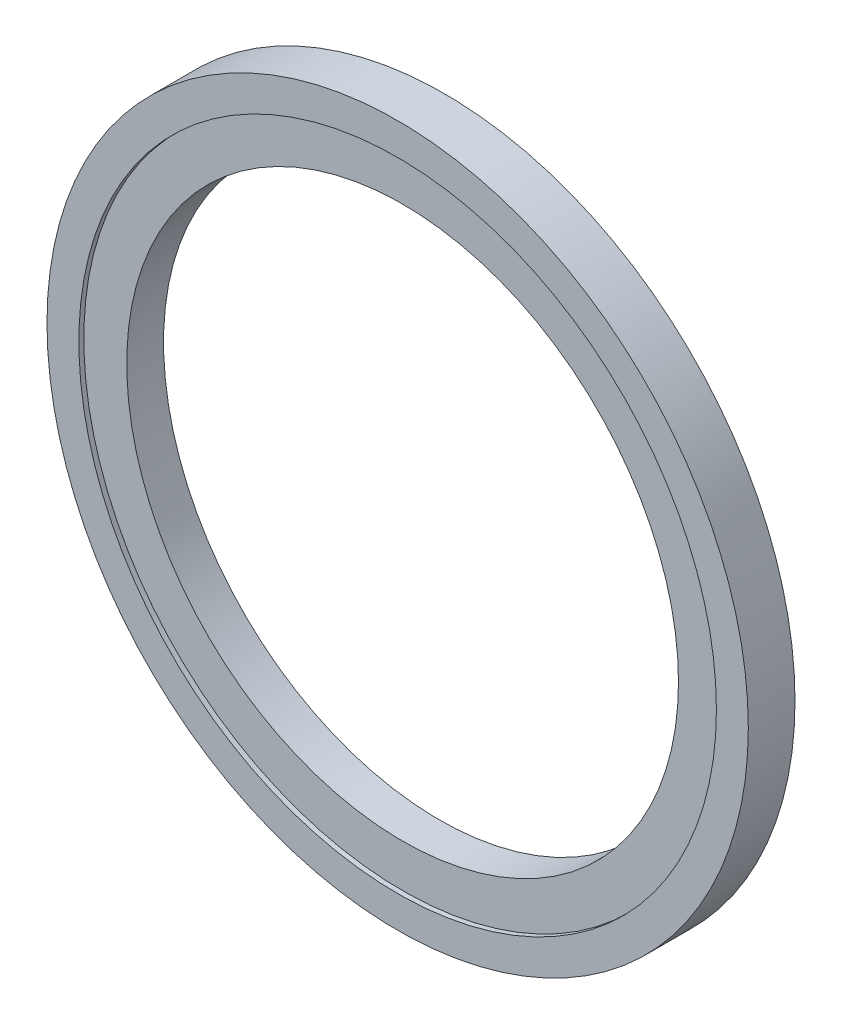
ISO-10303-21;
HEADER;
FILE_DESCRIPTION(('STEP AP214'),'2;1');
FILE_NAME('part.step','',(''),(''),'','','');
FILE_SCHEMA(('AUTOMOTIVE_DESIGN { 1 0 10303 214 1 1 1 1 }'));
ENDSEC;
DATA;
#1=APPLICATION_CONTEXT('core data for automotive mechanical design processes');
#2=APPLICATION_PROTOCOL_DEFINITION('international standard','automotive_design',2000,#1);
#3=PRODUCT_CONTEXT('',#1,'mechanical');
#4=PRODUCT('Part','Part','',(#3));
#5=PRODUCT_RELATED_PRODUCT_CATEGORY('part','',(#4));
#6=PRODUCT_DEFINITION_FORMATION('','',#4);
#7=PRODUCT_DEFINITION_CONTEXT('part definition',#1,'design');
#8=PRODUCT_DEFINITION('design','',#6,#7);
#9=PRODUCT_DEFINITION_SHAPE('','',#8);
#10=(LENGTH_UNIT() NAMED_UNIT(*) SI_UNIT(.MILLI.,.METRE.));
#11=(NAMED_UNIT(*) PLANE_ANGLE_UNIT() SI_UNIT($,.RADIAN.));
#12=(NAMED_UNIT(*) SI_UNIT($,.STERADIAN.) SOLID_ANGLE_UNIT());
#13=UNCERTAINTY_MEASURE_WITH_UNIT(LENGTH_MEASURE(1.E-05),#10,'distance_accuracy_value','');
#14=(GEOMETRIC_REPRESENTATION_CONTEXT(3) GLOBAL_UNCERTAINTY_ASSIGNED_CONTEXT((#13)) GLOBAL_UNIT_ASSIGNED_CONTEXT((#10,
#11,#12)) REPRESENTATION_CONTEXT('',''));
#15=CARTESIAN_POINT('',(0.,0.,0.));
#16=DIRECTION('',(0.,0.,1.));
#17=DIRECTION('',(1.,0.,0.));
#18=AXIS2_PLACEMENT_3D('',#15,#16,#17);
#19=CARTESIAN_POINT('',(0.,0.,-19.05));
#20=DIRECTION('',(0.,0.,1.));
#21=DIRECTION('',(1.,0.,0.));
#22=AXIS2_PLACEMENT_3D('',#19,#20,#21);
#23=CYLINDRICAL_SURFACE('',#22,260.);
#24=CARTESIAN_POINT('',(0.,0.,-19.05));
#25=DIRECTION('',(0.,0.,1.));
#26=DIRECTION('',(1.,0.,0.));
#27=AXIS2_PLACEMENT_3D('',#24,#25,#26);
#28=CIRCLE('',#27,260.);
#29=CARTESIAN_POINT('',(260.,0.,-19.05));
#30=VERTEX_POINT('',#29);
#31=EDGE_CURVE('E80',#30,#30,#28,.T.);
#32=CARTESIAN_POINT('',(0.,0.,-15.));
#33=DIRECTION('',(0.,0.,1.));
#34=DIRECTION('',(1.,0.,0.));
#35=AXIS2_PLACEMENT_3D('',#32,#33,#34);
#36=CIRCLE('',#35,260.);
#37=CARTESIAN_POINT('',(260.,0.,-15.));
#38=VERTEX_POINT('',#37);
#39=EDGE_CURVE('E11',#38,#38,#36,.F.);
#40=CARTESIAN_POINT('',(260.,0.,-19.05));
#41=CARTESIAN_POINT('',(260.,0.,-19.0078125));
#42=CARTESIAN_POINT('',(260.,0.,-18.965625));
#43=CARTESIAN_POINT('',(260.,0.,-18.88125));
#44=CARTESIAN_POINT('',(260.,0.,-18.8390625));
#45=CARTESIAN_POINT('',(260.,0.,-18.7546875));
#46=CARTESIAN_POINT('',(260.,0.,-18.7125));
#47=CARTESIAN_POINT('',(260.,0.,-18.628125));
#48=CARTESIAN_POINT('',(260.,0.,-18.5859375));
#49=CARTESIAN_POINT('',(260.,0.,-18.5015625));
#50=CARTESIAN_POINT('',(260.,0.,-18.459375));
#51=CARTESIAN_POINT('',(260.,0.,-18.375));
#52=CARTESIAN_POINT('',(260.,0.,-18.3328125));
#53=CARTESIAN_POINT('',(260.,0.,-18.2484375));
#54=CARTESIAN_POINT('',(260.,0.,-18.20625));
#55=CARTESIAN_POINT('',(260.,0.,-18.121875));
#56=CARTESIAN_POINT('',(260.,0.,-18.0796875));
#57=CARTESIAN_POINT('',(260.,0.,-17.9953125));
#58=CARTESIAN_POINT('',(260.,0.,-17.953125));
#59=CARTESIAN_POINT('',(260.,0.,-17.86875));
#60=CARTESIAN_POINT('',(260.,0.,-17.8265625));
#61=CARTESIAN_POINT('',(260.,0.,-17.7421875));
#62=CARTESIAN_POINT('',(260.,0.,-17.7));
#63=CARTESIAN_POINT('',(260.,0.,-17.615625));
#64=CARTESIAN_POINT('',(260.,0.,-17.5734375));
#65=CARTESIAN_POINT('',(260.,0.,-17.4890625));
#66=CARTESIAN_POINT('',(260.,0.,-17.446875));
#67=CARTESIAN_POINT('',(260.,0.,-17.3625));
#68=CARTESIAN_POINT('',(260.,0.,-17.3203125));
#69=CARTESIAN_POINT('',(260.,0.,-17.2359375));
#70=CARTESIAN_POINT('',(260.,0.,-17.19375));
#71=CARTESIAN_POINT('',(260.,0.,-17.109375));
#72=CARTESIAN_POINT('',(260.,0.,-17.0671875));
#73=CARTESIAN_POINT('',(260.,0.,-16.9828125));
#74=CARTESIAN_POINT('',(260.,0.,-16.940625));
#75=CARTESIAN_POINT('',(260.,0.,-16.85625));
#76=CARTESIAN_POINT('',(260.,0.,-16.8140625));
#77=CARTESIAN_POINT('',(260.,0.,-16.7296875));
#78=CARTESIAN_POINT('',(260.,0.,-16.6875));
#79=CARTESIAN_POINT('',(260.,0.,-16.603125));
#80=CARTESIAN_POINT('',(260.,0.,-16.5609375));
#81=CARTESIAN_POINT('',(260.,0.,-16.4765625));
#82=CARTESIAN_POINT('',(260.,0.,-16.434375));
#83=CARTESIAN_POINT('',(260.,0.,-16.35));
#84=CARTESIAN_POINT('',(260.,0.,-16.3078125));
#85=CARTESIAN_POINT('',(260.,0.,-16.2234375));
#86=CARTESIAN_POINT('',(260.,0.,-16.18125));
#87=CARTESIAN_POINT('',(260.,0.,-16.096875));
#88=CARTESIAN_POINT('',(260.,0.,-16.0546875));
#89=CARTESIAN_POINT('',(260.,0.,-15.9703125));
#90=CARTESIAN_POINT('',(260.,0.,-15.928125));
#91=CARTESIAN_POINT('',(260.,0.,-15.84375));
#92=CARTESIAN_POINT('',(260.,0.,-15.8015625));
#93=CARTESIAN_POINT('',(260.,0.,-15.7171875));
#94=CARTESIAN_POINT('',(260.,0.,-15.675));
#95=CARTESIAN_POINT('',(260.,0.,-15.590625));
#96=CARTESIAN_POINT('',(260.,0.,-15.5484375));
#97=CARTESIAN_POINT('',(260.,0.,-15.4640625));
#98=CARTESIAN_POINT('',(260.,0.,-15.421875));
#99=CARTESIAN_POINT('',(260.,0.,-15.3375));
#100=CARTESIAN_POINT('',(260.,0.,-15.2953125));
#101=CARTESIAN_POINT('',(260.,0.,-15.2109375));
#102=CARTESIAN_POINT('',(260.,0.,-15.16875));
#103=CARTESIAN_POINT('',(260.,0.,-15.084375));
#104=CARTESIAN_POINT('',(260.,0.,-15.0421875));
#105=CARTESIAN_POINT('',(260.,0.,-15.));
#106=B_SPLINE_CURVE_WITH_KNOTS('',3,(#40,#41,#42,#43,#44,#45,#46,#47,#48,#49,#50,#51,#52,#53,
#54,#55,#56,#57,#58,#59,#60,#61,#62,#63,#64,#65,#66,#67,#68,#69,#70,#71,#72,#73,#74,#75,#76,#77,
#78,#79,#80,#81,#82,#83,#84,#85,#86,#87,#88,#89,#90,#91,#92,#93,#94,#95,#96,#97,#98,#99,#100,
#101,#102,#103,#104,#105),.UNSPECIFIED.,.F.,.F.,(4,2,2,2,2,2,2,2,2,2,2,2,2,2,2,2,2,2,2,2,2,2,2,
2,2,2,2,2,2,2,2,2,4),(0.,0.126562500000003,0.253125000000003,0.379687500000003,
0.506250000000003,0.632812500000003,0.759375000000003,0.885937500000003,1.0125,1.1390625,
1.265625,1.3921875,1.51875,1.6453125,1.771875,1.8984375,2.025,2.1515625,2.278125,2.4046875,
2.53125,2.6578125,2.784375,2.9109375,3.03750000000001,3.1640625,3.29062500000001,
3.41718750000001,3.54375,3.6703125,3.79687500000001,3.92343750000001,4.05000000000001),.UNSPECIFIED.);
#107=EDGE_CURVE('BSEAM67',#30,#38,#106,.T.);
#108=ORIENTED_EDGE('',*,*,#31,.F.);
#109=ORIENTED_EDGE('',*,*,#39,.F.);
#110=ORIENTED_EDGE('',*,*,#107,.T.);
#111=ORIENTED_EDGE('',*,*,#107,.F.);
#112=EDGE_LOOP('',(#108,#110,#109,#111));
#113=FACE_BOUND('',#112,.T.);
#114=ADVANCED_FACE('F67',(#113),#23,.F.);
#115=CARTESIAN_POINT('',(0.,0.,-19.05));
#116=DIRECTION('',(0.,0.,1.));
#117=DIRECTION('',(1.,0.,0.));
#118=AXIS2_PLACEMENT_3D('',#115,#116,#117);
#119=CYLINDRICAL_SURFACE('',#118,286.);
#120=CARTESIAN_POINT('',(0.,0.,-19.05));
#121=DIRECTION('',(0.,0.,1.));
#122=DIRECTION('',(1.,0.,0.));
#123=AXIS2_PLACEMENT_3D('',#120,#121,#122);
#124=CIRCLE('',#123,286.);
#125=CARTESIAN_POINT('',(286.,0.,-19.05));
#126=VERTEX_POINT('',#125);
#127=EDGE_CURVE('E75',#126,#126,#124,.T.);
#128=CARTESIAN_POINT('',(0.,0.,19.05));
#129=DIRECTION('',(0.,0.,1.));
#130=DIRECTION('',(1.,0.,0.));
#131=AXIS2_PLACEMENT_3D('',#128,#129,#130);
#132=CIRCLE('',#131,286.);
#133=CARTESIAN_POINT('',(286.,0.,19.05));
#134=VERTEX_POINT('',#133);
#135=EDGE_CURVE('E85',#134,#134,#132,.T.);
#136=CARTESIAN_POINT('',(286.,0.,-19.05));
#137=CARTESIAN_POINT('',(286.,0.,-18.653125));
#138=CARTESIAN_POINT('',(286.,0.,-18.25625));
#139=CARTESIAN_POINT('',(286.,0.,-17.4625));
#140=CARTESIAN_POINT('',(286.,0.,-17.065625));
#141=CARTESIAN_POINT('',(286.,0.,-16.271875));
#142=CARTESIAN_POINT('',(286.,0.,-15.875));
#143=CARTESIAN_POINT('',(286.,0.,-15.08125));
#144=CARTESIAN_POINT('',(286.,0.,-14.684375));
#145=CARTESIAN_POINT('',(286.,0.,-13.890625));
#146=CARTESIAN_POINT('',(286.,0.,-13.49375));
#147=CARTESIAN_POINT('',(286.,0.,-12.7));
#148=CARTESIAN_POINT('',(286.,0.,-12.303125));
#149=CARTESIAN_POINT('',(286.,0.,-11.509375));
#150=CARTESIAN_POINT('',(286.,0.,-11.1125));
#151=CARTESIAN_POINT('',(286.,0.,-10.31875));
#152=CARTESIAN_POINT('',(286.,0.,-9.921875));
#153=CARTESIAN_POINT('',(286.,0.,-9.128125));
#154=CARTESIAN_POINT('',(286.,0.,-8.73125));
#155=CARTESIAN_POINT('',(286.,0.,-7.9375));
#156=CARTESIAN_POINT('',(286.,0.,-7.540625));
#157=CARTESIAN_POINT('',(286.,0.,-6.746875));
#158=CARTESIAN_POINT('',(286.,0.,-6.35));
#159=CARTESIAN_POINT('',(286.,0.,-5.55625));
#160=CARTESIAN_POINT('',(286.,0.,-5.159375));
#161=CARTESIAN_POINT('',(286.,0.,-4.365625));
#162=CARTESIAN_POINT('',(286.,0.,-3.96875));
#163=CARTESIAN_POINT('',(286.,0.,-3.175));
#164=CARTESIAN_POINT('',(286.,0.,-2.778125));
#165=CARTESIAN_POINT('',(286.,0.,-1.984375));
#166=CARTESIAN_POINT('',(286.,0.,-1.5875));
#167=CARTESIAN_POINT('',(286.,0.,-0.793750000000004));
#168=CARTESIAN_POINT('',(286.,0.,-0.396875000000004));
#169=CARTESIAN_POINT('',(286.,0.,0.396874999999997));
#170=CARTESIAN_POINT('',(286.,0.,0.793749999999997));
#171=CARTESIAN_POINT('',(286.,0.,1.5875));
#172=CARTESIAN_POINT('',(286.,0.,1.984375));
#173=CARTESIAN_POINT('',(286.,0.,2.778125));
#174=CARTESIAN_POINT('',(286.,0.,3.175));
#175=CARTESIAN_POINT('',(286.,0.,3.96875));
#176=CARTESIAN_POINT('',(286.,0.,4.365625));
#177=CARTESIAN_POINT('',(286.,0.,5.159375));
#178=CARTESIAN_POINT('',(286.,0.,5.55625));
#179=CARTESIAN_POINT('',(286.,0.,6.35));
#180=CARTESIAN_POINT('',(286.,0.,6.746875));
#181=CARTESIAN_POINT('',(286.,0.,7.540625));
#182=CARTESIAN_POINT('',(286.,0.,7.9375));
#183=CARTESIAN_POINT('',(286.,0.,8.73125));
#184=CARTESIAN_POINT('',(286.,0.,9.128125));
#185=CARTESIAN_POINT('',(286.,0.,9.921875));
#186=CARTESIAN_POINT('',(286.,0.,10.31875));
#187=CARTESIAN_POINT('',(286.,0.,11.1125));
#188=CARTESIAN_POINT('',(286.,0.,11.509375));
#189=CARTESIAN_POINT('',(286.,0.,12.303125));
#190=CARTESIAN_POINT('',(286.,0.,12.7));
#191=CARTESIAN_POINT('',(286.,0.,13.49375));
#192=CARTESIAN_POINT('',(286.,0.,13.890625));
#193=CARTESIAN_POINT('',(286.,0.,14.684375));
#194=CARTESIAN_POINT('',(286.,0.,15.08125));
#195=CARTESIAN_POINT('',(286.,0.,15.875));
#196=CARTESIAN_POINT('',(286.,0.,16.271875));
#197=CARTESIAN_POINT('',(286.,0.,17.065625));
#198=CARTESIAN_POINT('',(286.,0.,17.4625));
#199=CARTESIAN_POINT('',(286.,0.,18.25625));
#200=CARTESIAN_POINT('',(286.,0.,18.653125));
#201=CARTESIAN_POINT('',(286.,0.,19.05));
#202=B_SPLINE_CURVE_WITH_KNOTS('',3,(#136,#137,#138,#139,#140,#141,#142,#143,#144,#145,#146,
#147,#148,#149,#150,#151,#152,#153,#154,#155,#156,#157,#158,#159,#160,#161,#162,#163,#164,#165,
#166,#167,#168,#169,#170,#171,#172,#173,#174,#175,#176,#177,#178,#179,#180,#181,#182,#183,#184,
#185,#186,#187,#188,#189,#190,#191,#192,#193,#194,#195,#196,#197,#198,#199,#200,#201),
.UNSPECIFIED.,.F.,.F.,(4,2,2,2,2,2,2,2,2,2,2,2,2,2,2,2,2,2,2,2,2,2,2,2,2,2,2,2,2,2,2,2,4),(0.,
1.190625,2.38125,3.571875,4.7625,5.953125,7.14375,8.334375,9.525,10.715625,11.90625,13.096875,
14.2875,15.478125,16.66875,17.859375,19.05,20.240625,21.43125,22.621875,23.8125,25.003125,
26.19375,27.384375,28.575,29.765625,30.95625,32.146875,33.3375,34.528125,35.71875,36.909375,
38.1),.UNSPECIFIED.);
#203=EDGE_CURVE('BSEAM69',#126,#134,#202,.T.);
#204=ORIENTED_EDGE('',*,*,#127,.T.);
#205=ORIENTED_EDGE('',*,*,#135,.F.);
#206=ORIENTED_EDGE('',*,*,#203,.T.);
#207=ORIENTED_EDGE('',*,*,#203,.F.);
#208=EDGE_LOOP('',(#204,#206,#205,#207));
#209=FACE_BOUND('',#208,.T.);
#210=ADVANCED_FACE('F69',(#209),#119,.T.);
#211=CARTESIAN_POINT('',(0.,0.,-19.05));
#212=DIRECTION('',(0.,0.,1.));
#213=DIRECTION('',(1.,0.,0.));
#214=AXIS2_PLACEMENT_3D('',#211,#212,#213);
#215=PLANE('',#214);
#216=ORIENTED_EDGE('',*,*,#31,.T.);
#217=EDGE_LOOP('',(#216));
#218=FACE_BOUND('',#217,.T.);
#219=ORIENTED_EDGE('',*,*,#127,.F.);
#220=EDGE_LOOP('',(#219));
#221=FACE_BOUND('',#220,.T.);
#222=ADVANCED_FACE('F129',(#218,#221),#215,.F.);
#223=CARTESIAN_POINT('',(0.,0.,15.));
#224=DIRECTION('',(0.,0.,1.));
#225=DIRECTION('',(1.,0.,0.));
#226=AXIS2_PLACEMENT_3D('',#223,#224,#225);
#227=CIRCLE('',#226,260.);
#228=CARTESIAN_POINT('',(260.,0.,15.));
#229=VERTEX_POINT('',#228);
#230=EDGE_CURVE('E99',#229,#229,#227,.T.);
#231=CARTESIAN_POINT('',(0.,0.,19.05));
#232=DIRECTION('',(0.,0.,1.));
#233=DIRECTION('',(1.,0.,0.));
#234=AXIS2_PLACEMENT_3D('',#231,#232,#233);
#235=CIRCLE('',#234,260.);
#236=CARTESIAN_POINT('',(260.,0.,19.05));
#237=VERTEX_POINT('',#236);
#238=EDGE_CURVE('E91',#237,#237,#235,.T.);
#239=CARTESIAN_POINT('',(260.,0.,15.));
#240=CARTESIAN_POINT('',(260.,0.,15.0421875));
#241=CARTESIAN_POINT('',(260.,0.,15.084375));
#242=CARTESIAN_POINT('',(260.,0.,15.16875));
#243=CARTESIAN_POINT('',(260.,0.,15.2109375));
#244=CARTESIAN_POINT('',(260.,0.,15.2953125));
#245=CARTESIAN_POINT('',(260.,0.,15.3375));
#246=CARTESIAN_POINT('',(260.,0.,15.421875));
#247=CARTESIAN_POINT('',(260.,0.,15.4640625));
#248=CARTESIAN_POINT('',(260.,0.,15.5484375));
#249=CARTESIAN_POINT('',(260.,0.,15.590625));
#250=CARTESIAN_POINT('',(260.,0.,15.675));
#251=CARTESIAN_POINT('',(260.,0.,15.7171875));
#252=CARTESIAN_POINT('',(260.,0.,15.8015625));
#253=CARTESIAN_POINT('',(260.,0.,15.84375));
#254=CARTESIAN_POINT('',(260.,0.,15.928125));
#255=CARTESIAN_POINT('',(260.,0.,15.9703125));
#256=CARTESIAN_POINT('',(260.,0.,16.0546875));
#257=CARTESIAN_POINT('',(260.,0.,16.096875));
#258=CARTESIAN_POINT('',(260.,0.,16.18125));
#259=CARTESIAN_POINT('',(260.,0.,16.2234375));
#260=CARTESIAN_POINT('',(260.,0.,16.3078125));
#261=CARTESIAN_POINT('',(260.,0.,16.35));
#262=CARTESIAN_POINT('',(260.,0.,16.434375));
#263=CARTESIAN_POINT('',(260.,0.,16.4765625));
#264=CARTESIAN_POINT('',(260.,0.,16.5609375));
#265=CARTESIAN_POINT('',(260.,0.,16.603125));
#266=CARTESIAN_POINT('',(260.,0.,16.6875));
#267=CARTESIAN_POINT('',(260.,0.,16.7296875));
#268=CARTESIAN_POINT('',(260.,0.,16.8140625));
#269=CARTESIAN_POINT('',(260.,0.,16.85625));
#270=CARTESIAN_POINT('',(260.,0.,16.940625));
#271=CARTESIAN_POINT('',(260.,0.,16.9828125));
#272=CARTESIAN_POINT('',(260.,0.,17.0671875));
#273=CARTESIAN_POINT('',(260.,0.,17.109375));
#274=CARTESIAN_POINT('',(260.,0.,17.19375));
#275=CARTESIAN_POINT('',(260.,0.,17.2359375));
#276=CARTESIAN_POINT('',(260.,0.,17.3203125));
#277=CARTESIAN_POINT('',(260.,0.,17.3625));
#278=CARTESIAN_POINT('',(260.,0.,17.446875));
#279=CARTESIAN_POINT('',(260.,0.,17.4890625));
#280=CARTESIAN_POINT('',(260.,0.,17.5734375));
#281=CARTESIAN_POINT('',(260.,0.,17.615625));
#282=CARTESIAN_POINT('',(260.,0.,17.7));
#283=CARTESIAN_POINT('',(260.,0.,17.7421875));
#284=CARTESIAN_POINT('',(260.,0.,17.8265625));
#285=CARTESIAN_POINT('',(260.,0.,17.86875));
#286=CARTESIAN_POINT('',(260.,0.,17.953125));
#287=CARTESIAN_POINT('',(260.,0.,17.9953125));
#288=CARTESIAN_POINT('',(260.,0.,18.0796875));
#289=CARTESIAN_POINT('',(260.,0.,18.121875));
#290=CARTESIAN_POINT('',(260.,0.,18.20625));
#291=CARTESIAN_POINT('',(260.,0.,18.2484375));
#292=CARTESIAN_POINT('',(260.,0.,18.3328125));
#293=CARTESIAN_POINT('',(260.,0.,18.375));
#294=CARTESIAN_POINT('',(260.,0.,18.459375));
#295=CARTESIAN_POINT('',(260.,0.,18.5015625));
#296=CARTESIAN_POINT('',(260.,0.,18.5859375));
#297=CARTESIAN_POINT('',(260.,0.,18.628125));
#298=CARTESIAN_POINT('',(260.,0.,18.7125));
#299=CARTESIAN_POINT('',(260.,0.,18.7546875));
#300=CARTESIAN_POINT('',(260.,0.,18.8390625));
#301=CARTESIAN_POINT('',(260.,0.,18.88125));
#302=CARTESIAN_POINT('',(260.,0.,18.965625));
#303=CARTESIAN_POINT('',(260.,0.,19.0078125));
#304=CARTESIAN_POINT('',(260.,0.,19.05));
#305=B_SPLINE_CURVE_WITH_KNOTS('',3,(#239,#240,#241,#242,#243,#244,#245,#246,#247,#248,#249,
#250,#251,#252,#253,#254,#255,#256,#257,#258,#259,#260,#261,#262,#263,#264,#265,#266,#267,#268,
#269,#270,#271,#272,#273,#274,#275,#276,#277,#278,#279,#280,#281,#282,#283,#284,#285,#286,#287,
#288,#289,#290,#291,#292,#293,#294,#295,#296,#297,#298,#299,#300,#301,#302,#303,#304),
.UNSPECIFIED.,.F.,.F.,(4,2,2,2,2,2,2,2,2,2,2,2,2,2,2,2,2,2,2,2,2,2,2,2,2,2,2,2,2,2,2,2,4),(0.,
0.126562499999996,0.253125,0.379687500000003,0.50625,0.632812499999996,0.759375,
0.885937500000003,1.0125,1.1390625,1.265625,1.3921875,1.51875,1.6453125,1.771875,1.8984375,
2.025,2.1515625,2.278125,2.4046875,2.53125,2.6578125,2.784375,2.9109375,3.0375,3.1640625,
3.290625,3.4171875,3.54375,3.67031249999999,3.796875,3.9234375,4.05),.UNSPECIFIED.);
#306=EDGE_CURVE('BSEAM123',#229,#237,#305,.T.);
#307=ORIENTED_EDGE('',*,*,#230,.F.);
#308=ORIENTED_EDGE('',*,*,#238,.T.);
#309=ORIENTED_EDGE('',*,*,#306,.T.);
#310=ORIENTED_EDGE('',*,*,#306,.F.);
#311=EDGE_LOOP('',(#307,#309,#308,#310));
#312=FACE_BOUND('',#311,.T.);
#313=ADVANCED_FACE('F123',(#312),#23,.F.);
#314=CARTESIAN_POINT('',(0.,0.,19.05));
#315=DIRECTION('',(0.,0.,1.));
#316=DIRECTION('',(1.,0.,0.));
#317=AXIS2_PLACEMENT_3D('',#314,#315,#316);
#318=PLANE('',#317);
#319=ORIENTED_EDGE('',*,*,#135,.T.);
#320=EDGE_LOOP('',(#319));
#321=FACE_BOUND('',#320,.T.);
#322=ORIENTED_EDGE('',*,*,#238,.F.);
#323=EDGE_LOOP('',(#322));
#324=FACE_BOUND('',#323,.T.);
#325=ADVANCED_FACE('F133',(#321,#324),#318,.T.);
#326=CARTESIAN_POINT('',(0.,0.,-15.));
#327=DIRECTION('',(0.,0.,1.));
#328=DIRECTION('',(1.,0.,0.));
#329=AXIS2_PLACEMENT_3D('',#326,#327,#328);
#330=PLANE('',#329);
#331=CARTESIAN_POINT('',(0.,0.,-15.));
#332=DIRECTION('',(0.,0.,1.));
#333=DIRECTION('',(1.,0.,0.));
#334=AXIS2_PLACEMENT_3D('',#331,#332,#333);
#335=CIRCLE('',#334,225.);
#336=CARTESIAN_POINT('',(225.,0.,-15.));
#337=VERTEX_POINT('',#336);
#338=EDGE_CURVE('E95',#337,#337,#335,.T.);
#339=ORIENTED_EDGE('',*,*,#338,.T.);
#340=EDGE_LOOP('',(#339));
#341=FACE_BOUND('',#340,.T.);
#342=ORIENTED_EDGE('',*,*,#39,.T.);
#343=EDGE_LOOP('',(#342));
#344=FACE_BOUND('',#343,.T.);
#345=ADVANCED_FACE('F117',(#341,#344),#330,.F.);
#346=CARTESIAN_POINT('',(0.,0.,-15.));
#347=DIRECTION('',(0.,0.,1.));
#348=DIRECTION('',(1.,0.,0.));
#349=AXIS2_PLACEMENT_3D('',#346,#347,#348);
#350=CYLINDRICAL_SURFACE('',#349,225.);
#351=ORIENTED_EDGE('',*,*,#338,.F.);
#352=EDGE_LOOP('',(#351));
#353=FACE_BOUND('',#352,.T.);
#354=CARTESIAN_POINT('',(0.,0.,15.));
#355=DIRECTION('',(0.,0.,1.));
#356=DIRECTION('',(1.,0.,0.));
#357=AXIS2_PLACEMENT_3D('',#354,#355,#356);
#358=CIRCLE('',#357,225.);
#359=CARTESIAN_POINT('',(225.,0.,15.));
#360=VERTEX_POINT('',#359);
#361=EDGE_CURVE('E103',#360,#360,#358,.T.);
#362=ORIENTED_EDGE('',*,*,#361,.T.);
#363=EDGE_LOOP('',(#362));
#364=FACE_BOUND('',#363,.T.);
#365=ADVANCED_FACE('F108',(#353,#364),#350,.F.);
#366=CARTESIAN_POINT('',(0.,0.,15.));
#367=DIRECTION('',(0.,0.,1.));
#368=DIRECTION('',(1.,0.,0.));
#369=AXIS2_PLACEMENT_3D('',#366,#367,#368);
#370=PLANE('',#369);
#371=ORIENTED_EDGE('',*,*,#230,.T.);
#372=EDGE_LOOP('',(#371));
#373=FACE_BOUND('',#372,.T.);
#374=ORIENTED_EDGE('',*,*,#361,.F.);
#375=EDGE_LOOP('',(#374));
#376=FACE_BOUND('',#375,.T.);
#377=ADVANCED_FACE('F110',(#373,#376),#370,.T.);
#378=CLOSED_SHELL('',(#114,#210,#222,#313,#325,#345,#365,#377));
#379=MANIFOLD_SOLID_BREP('B2',#378);
#380=ADVANCED_BREP_SHAPE_REPRESENTATION('',(#18,#379),#14);
#381=SHAPE_DEFINITION_REPRESENTATION(#9,#380);
ENDSEC;
END-ISO-10303-21;
